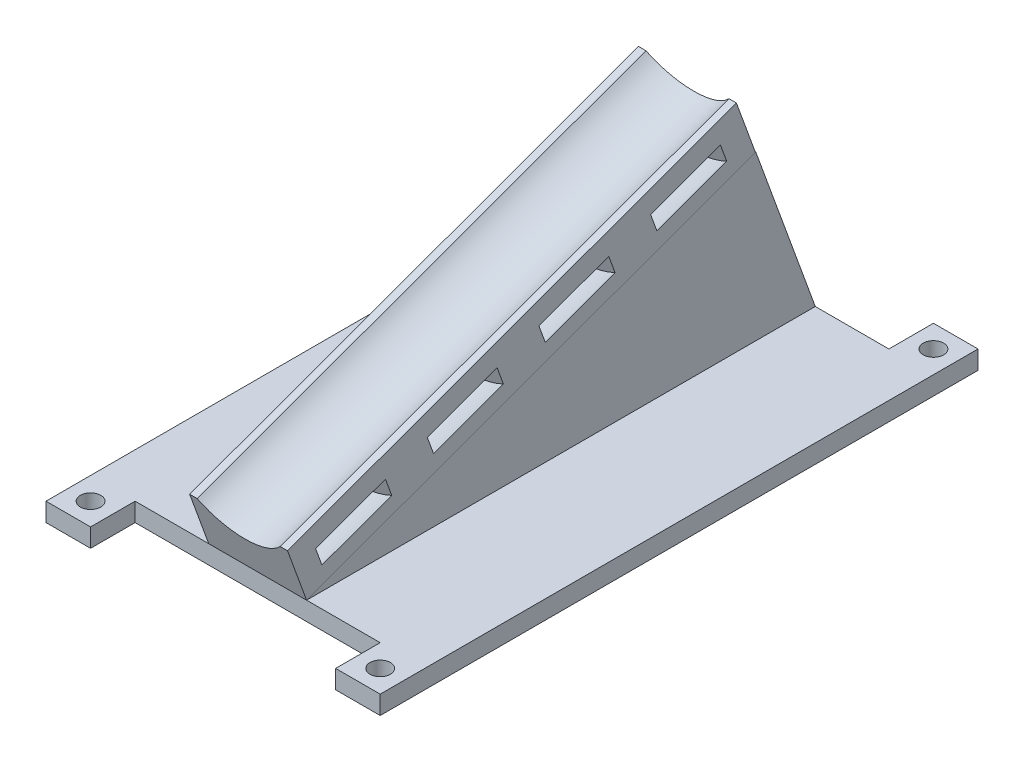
from build123d import *

# Parameters (mm, degrees)
SKETCH2_R           = 2.75
BOSS_EXTRUDE1_DEPTH = 5
BOSS_EXTRUDE2_DEPTH = 128.64
BOSS_EXTRUDE3_DEPTH = 26.360679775
LPATTERN1_COUNT     = 4
LPATTERN1_PITCH     = 32


with BuildPart() as part:
    # Sketch2 → Boss-Extrude1 (new body)
    with BuildSketch(Plane(origin=(0, 0, 0), x_dir=(1, 0, 0), z_dir=(0, 1, 0))):
        Polygon((0, 0), (12, 0), (12, 12), (78, 12), (78, 0), (90, 0), (90, 161), (78, 161), (78, 149), (12, 149), (12, 161), (0, 161), align=None)
        with Locations(Location((6, 155, 0), (0, 0, 270))):
            Circle(SKETCH2_R, mode=Mode.SUBTRACT)
        with Locations(Location((84, 155, 0), (0, 0, 270))):
            Circle(SKETCH2_R, mode=Mode.SUBTRACT)
        with Locations(Location((84, 6, 0), (0, 0, 270))):
            Circle(SKETCH2_R, mode=Mode.SUBTRACT)
        with Locations(Location((6, 6, 0), (0, 0, 270))):
            Circle(SKETCH2_R, mode=Mode.SUBTRACT)
    extrude(amount=BOSS_EXTRUDE1_DEPTH)

    # Sketch17 → Boss-Extrude3 (add)
    with BuildSketch(Plane(origin=(58.180339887, 0, 0), x_dir=(0, 0, -1), z_dir=(1, 0, 0))):
        Polygon((12, 5), (149, 5), (132.974044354, 49.030951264), align=None)
    extrude(amount=-BOSS_EXTRUDE3_DEPTH)


with BuildPart() as body_2:
    # Sketch15 → Boss-Extrude2 (new body)
    with BuildSketch(Plane(origin=(0, 4.44161455, -12.203235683), x_dir=(1, 0, 0), z_dir=(0, -0.34202014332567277, 0.9396926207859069))):
        with BuildLine():
            Line((31.819660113, 0.594221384), (58.180339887, 0.594221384))
            Line((58.180339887, 0.594221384), (58.180339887, 15.594221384))
            Line((58.180339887, 15.594221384), (56.180339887, 15.594221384))
            ThreePointArc((56.180339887, 15.594221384), (45, 10.594221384), (33.819660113, 15.594221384))
            Line((33.819660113, 15.594221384), (31.819660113, 15.594221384))
            Line((31.819660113, 15.594221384), (31.819660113, 0.594221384))
        make_face()
    extrude(amount=-BOSS_EXTRUDE2_DEPTH)

    # Sketch18 → Cut-Revolve1 (revolve, cut)
    with BuildSketch(Plane(origin=(45, 0, 0), x_dir=(0, 0, -1), z_dir=(1, 0, 0))):
        Polygon((17.447534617, 7.514829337), (36.241387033, 14.355232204), (34.87330646, 18.114002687), (16.079454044, 11.27359982), align=None)
    cut_revolve1 = revolve(axis=Axis((45, 67.343060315, -110.19104047), (0, -0.34202014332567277, 0.939692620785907)), mode=Mode.SUBTRACT)

    # LPattern1: Cut-Revolve1 ×4
    with Locations(*[Vector(0, 0.3420201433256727, -0.939692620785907) * (i * LPATTERN1_PITCH) for i in range(1, LPATTERN1_COUNT)]):
        add(cut_revolve1, mode=Mode.SUBTRACT)


solid = Compound([part.part, body_2.part])
